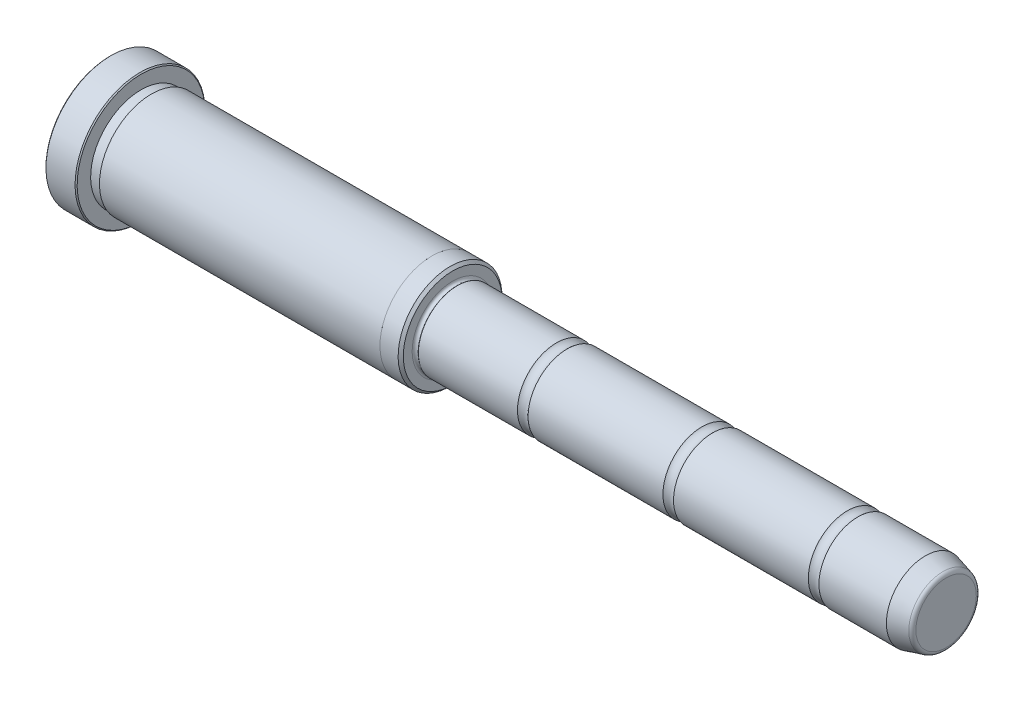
ISO-10303-21;
HEADER;
FILE_DESCRIPTION(('STEP AP214'),'2;1');
FILE_NAME('part.step','',(''),(''),'','','');
FILE_SCHEMA(('AUTOMOTIVE_DESIGN { 1 0 10303 214 1 1 1 1 }'));
ENDSEC;
DATA;
#1=APPLICATION_CONTEXT('core data for automotive mechanical design processes');
#2=APPLICATION_PROTOCOL_DEFINITION('international standard','automotive_design',2000,#1);
#3=PRODUCT_CONTEXT('',#1,'mechanical');
#4=PRODUCT('Part','Part','',(#3));
#5=PRODUCT_RELATED_PRODUCT_CATEGORY('part','',(#4));
#6=PRODUCT_DEFINITION_FORMATION('','',#4);
#7=PRODUCT_DEFINITION_CONTEXT('part definition',#1,'design');
#8=PRODUCT_DEFINITION('design','',#6,#7);
#9=PRODUCT_DEFINITION_SHAPE('','',#8);
#10=(LENGTH_UNIT() NAMED_UNIT(*) SI_UNIT(.MILLI.,.METRE.));
#11=(NAMED_UNIT(*) PLANE_ANGLE_UNIT() SI_UNIT($,.RADIAN.));
#12=(NAMED_UNIT(*) SI_UNIT($,.STERADIAN.) SOLID_ANGLE_UNIT());
#13=UNCERTAINTY_MEASURE_WITH_UNIT(LENGTH_MEASURE(1.E-05),#10,'distance_accuracy_value','');
#14=(GEOMETRIC_REPRESENTATION_CONTEXT(3) GLOBAL_UNCERTAINTY_ASSIGNED_CONTEXT((#13)) GLOBAL_UNIT_ASSIGNED_CONTEXT((#10,
#11,#12)) REPRESENTATION_CONTEXT('',''));
#15=CARTESIAN_POINT('',(0.,0.,0.));
#16=DIRECTION('',(0.,0.,1.));
#17=DIRECTION('',(1.,0.,0.));
#18=AXIS2_PLACEMENT_3D('',#15,#16,#17);
#19=CARTESIAN_POINT('',(95.,0.,0.));
#20=DIRECTION('',(1.,0.,0.));
#21=DIRECTION('',(0.,1.,0.));
#22=AXIS2_PLACEMENT_3D('',#19,#20,#21);
#23=CYLINDRICAL_SURFACE('',#22,7.49999999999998);
#24=CARTESIAN_POINT('',(0.899999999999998,0.,0.));
#25=DIRECTION('',(1.,0.,0.));
#26=DIRECTION('',(0.,1.,0.));
#27=AXIS2_PLACEMENT_3D('',#24,#25,#26);
#28=CIRCLE('',#27,7.49999999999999);
#29=CARTESIAN_POINT('',(0.899999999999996,7.5,0.));
#30=VERTEX_POINT('',#29);
#31=EDGE_CURVE('E63',#30,#30,#28,.T.);
#32=ORIENTED_EDGE('',*,*,#31,.T.);
#33=EDGE_LOOP('',(#32));
#34=FACE_BOUND('',#33,.T.);
#35=CARTESIAN_POINT('',(19.9801960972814,0.,0.));
#36=DIRECTION('',(-1.,0.,0.));
#37=DIRECTION('',(0.,-1.,0.));
#38=AXIS2_PLACEMENT_3D('',#35,#36,#37);
#39=CIRCLE('',#38,7.49999999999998);
#40=CARTESIAN_POINT('',(19.9801960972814,-7.49999999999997,0.));
#41=VERTEX_POINT('',#40);
#42=EDGE_CURVE('E99',#41,#41,#39,.T.);
#43=ORIENTED_EDGE('',*,*,#42,.T.);
#44=EDGE_LOOP('',(#43));
#45=FACE_BOUND('',#44,.T.);
#46=ADVANCED_FACE('F28',(#34,#45),#23,.T.);
#47=CARTESIAN_POINT('',(0.5,0.,0.));
#48=DIRECTION('',(1.,0.,0.));
#49=DIRECTION('',(0.,1.,0.));
#50=AXIS2_PLACEMENT_3D('',#47,#48,#49);
#51=TOROIDAL_SURFACE('',#50,7.79999999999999,0.5);
#52=CARTESIAN_POINT('',(0.,0.,0.));
#53=DIRECTION('',(1.,0.,0.));
#54=DIRECTION('',(0.,1.,0.));
#55=AXIS2_PLACEMENT_3D('',#52,#53,#54);
#56=CIRCLE('',#55,7.79999999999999);
#57=CARTESIAN_POINT('',(0.,7.8,0.));
#58=VERTEX_POINT('',#57);
#59=EDGE_CURVE('E66',#58,#58,#56,.T.);
#60=ORIENTED_EDGE('',*,*,#59,.T.);
#61=EDGE_LOOP('',(#60));
#62=FACE_BOUND('',#61,.T.);
#63=ORIENTED_EDGE('',*,*,#31,.F.);
#64=EDGE_LOOP('',(#63));
#65=FACE_BOUND('',#64,.T.);
#66=ADVANCED_FACE('F122',(#62,#65),#51,.F.);
#67=CARTESIAN_POINT('',(0.,7.8,0.));
#68=DIRECTION('',(1.,0.,0.));
#69=DIRECTION('',(0.,1.,0.));
#70=AXIS2_PLACEMENT_3D('',#67,#68,#69);
#71=PLANE('',#70);
#72=CARTESIAN_POINT('',(0.,0.,0.));
#73=DIRECTION('',(1.,0.,0.));
#74=DIRECTION('',(0.,1.,0.));
#75=AXIS2_PLACEMENT_3D('',#72,#73,#74);
#76=CIRCLE('',#75,9.49999999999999);
#77=CARTESIAN_POINT('',(0.,9.5,0.));
#78=VERTEX_POINT('',#77);
#79=EDGE_CURVE('E35',#78,#78,#76,.T.);
#80=ORIENTED_EDGE('',*,*,#79,.T.);
#81=EDGE_LOOP('',(#80));
#82=FACE_BOUND('',#81,.T.);
#83=ORIENTED_EDGE('',*,*,#59,.F.);
#84=EDGE_LOOP('',(#83));
#85=FACE_BOUND('',#84,.T.);
#86=ADVANCED_FACE('F130',(#82,#85),#71,.T.);
#87=CARTESIAN_POINT('',(95.,0.,0.));
#88=DIRECTION('',(1.,0.,0.));
#89=DIRECTION('',(0.,1.,0.));
#90=AXIS2_PLACEMENT_3D('',#87,#88,#89);
#91=CYLINDRICAL_SURFACE('',#90,9.99999999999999);
#92=CARTESIAN_POINT('',(-0.499999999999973,0.,0.));
#93=DIRECTION('',(1.,0.,0.));
#94=DIRECTION('',(0.,1.,0.));
#95=AXIS2_PLACEMENT_3D('',#92,#93,#94);
#96=CIRCLE('',#95,9.99999999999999);
#97=CARTESIAN_POINT('',(-0.499999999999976,10.,0.));
#98=VERTEX_POINT('',#97);
#99=EDGE_CURVE('E10',#98,#98,#96,.F.);
#100=ORIENTED_EDGE('',*,*,#99,.T.);
#101=EDGE_LOOP('',(#100));
#102=FACE_BOUND('',#101,.T.);
#103=CARTESIAN_POINT('',(-4.,0.,0.));
#104=DIRECTION('',(1.,0.,0.));
#105=DIRECTION('',(0.,1.,0.));
#106=AXIS2_PLACEMENT_3D('',#103,#104,#105);
#107=CIRCLE('',#106,9.99999999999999);
#108=CARTESIAN_POINT('',(-4.00000000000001,10.,0.));
#109=VERTEX_POINT('',#108);
#110=EDGE_CURVE('E69',#109,#109,#107,.T.);
#111=ORIENTED_EDGE('',*,*,#110,.T.);
#112=EDGE_LOOP('',(#111));
#113=FACE_BOUND('',#112,.T.);
#114=ADVANCED_FACE('F190',(#102,#113),#91,.T.);
#115=CARTESIAN_POINT('',(-4.,10.001,0.));
#116=DIRECTION('',(1.,0.,0.));
#117=DIRECTION('',(0.,1.,0.));
#118=AXIS2_PLACEMENT_3D('',#115,#116,#117);
#119=PLANE('',#118);
#120=CARTESIAN_POINT('',(-4.,0.,0.));
#121=DIRECTION('',(1.,0.,0.));
#122=DIRECTION('',(0.,1.,0.));
#123=AXIS2_PLACEMENT_3D('',#120,#121,#122);
#124=CIRCLE('',#123,10.001);
#125=CARTESIAN_POINT('',(-4.00000000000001,10.001,0.));
#126=VERTEX_POINT('',#125);
#127=EDGE_CURVE('E72',#126,#126,#124,.T.);
#128=ORIENTED_EDGE('',*,*,#127,.T.);
#129=EDGE_LOOP('',(#128));
#130=FACE_BOUND('',#129,.T.);
#131=ORIENTED_EDGE('',*,*,#110,.F.);
#132=EDGE_LOOP('',(#131));
#133=FACE_BOUND('',#132,.T.);
#134=ADVANCED_FACE('F186',(#130,#133),#119,.T.);
#135=CARTESIAN_POINT('',(95.,0.,0.));
#136=DIRECTION('',(1.,0.,0.));
#137=DIRECTION('',(0.,1.,0.));
#138=AXIS2_PLACEMENT_3D('',#135,#136,#137);
#139=CYLINDRICAL_SURFACE('',#138,10.001);
#140=CARTESIAN_POINT('',(-58.,0.,0.));
#141=DIRECTION('',(1.,0.,0.));
#142=DIRECTION('',(0.,1.,0.));
#143=AXIS2_PLACEMENT_3D('',#140,#141,#142);
#144=CIRCLE('',#143,10.001);
#145=CARTESIAN_POINT('',(-58.,10.001,0.));
#146=VERTEX_POINT('',#145);
#147=EDGE_CURVE('E75',#146,#146,#144,.T.);
#148=ORIENTED_EDGE('',*,*,#147,.T.);
#149=EDGE_LOOP('',(#148));
#150=FACE_BOUND('',#149,.T.);
#151=ORIENTED_EDGE('',*,*,#127,.F.);
#152=EDGE_LOOP('',(#151));
#153=FACE_BOUND('',#152,.T.);
#154=ADVANCED_FACE('F182',(#150,#153),#139,.T.);
#155=CARTESIAN_POINT('',(-58.,10.001,0.));
#156=DIRECTION('',(-1.,0.,0.));
#157=DIRECTION('',(0.,-1.,0.));
#158=AXIS2_PLACEMENT_3D('',#155,#156,#157);
#159=PLANE('',#158);
#160=CARTESIAN_POINT('',(-58.,0.,0.));
#161=DIRECTION('',(1.,0.,0.));
#162=DIRECTION('',(0.,1.,0.));
#163=AXIS2_PLACEMENT_3D('',#160,#161,#162);
#164=CIRCLE('',#163,9.69999999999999);
#165=CARTESIAN_POINT('',(-58.,9.69999999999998,0.));
#166=VERTEX_POINT('',#165);
#167=EDGE_CURVE('E78',#166,#166,#164,.T.);
#168=ORIENTED_EDGE('',*,*,#167,.T.);
#169=EDGE_LOOP('',(#168));
#170=FACE_BOUND('',#169,.T.);
#171=ORIENTED_EDGE('',*,*,#147,.F.);
#172=EDGE_LOOP('',(#171));
#173=FACE_BOUND('',#172,.T.);
#174=ADVANCED_FACE('F178',(#170,#173),#159,.T.);
#175=CARTESIAN_POINT('',(95.,0.,0.));
#176=DIRECTION('',(1.,0.,0.));
#177=DIRECTION('',(0.,1.,0.));
#178=AXIS2_PLACEMENT_3D('',#175,#176,#177);
#179=CYLINDRICAL_SURFACE('',#178,9.69999999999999);
#180=CARTESIAN_POINT('',(-60.,0.,0.));
#181=DIRECTION('',(1.,0.,0.));
#182=DIRECTION('',(0.,1.,0.));
#183=AXIS2_PLACEMENT_3D('',#180,#181,#182);
#184=CIRCLE('',#183,9.69999999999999);
#185=CARTESIAN_POINT('',(-60.,9.69999999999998,0.));
#186=VERTEX_POINT('',#185);
#187=EDGE_CURVE('E81',#186,#186,#184,.T.);
#188=ORIENTED_EDGE('',*,*,#187,.T.);
#189=EDGE_LOOP('',(#188));
#190=FACE_BOUND('',#189,.T.);
#191=ORIENTED_EDGE('',*,*,#167,.F.);
#192=EDGE_LOOP('',(#191));
#193=FACE_BOUND('',#192,.T.);
#194=ADVANCED_FACE('F174',(#190,#193),#179,.T.);
#195=CARTESIAN_POINT('',(-60.,9.69999999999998,0.));
#196=DIRECTION('',(1.,0.,0.));
#197=DIRECTION('',(0.,1.,0.));
#198=AXIS2_PLACEMENT_3D('',#195,#196,#197);
#199=PLANE('',#198);
#200=CARTESIAN_POINT('',(-60.,0.,0.));
#201=DIRECTION('',(1.,0.,0.));
#202=DIRECTION('',(0.,1.,0.));
#203=AXIS2_PLACEMENT_3D('',#200,#201,#202);
#204=CIRCLE('',#203,12.3);
#205=CARTESIAN_POINT('',(-60.,12.3,0.));
#206=VERTEX_POINT('',#205);
#207=EDGE_CURVE('E39',#206,#206,#204,.T.);
#208=ORIENTED_EDGE('',*,*,#207,.T.);
#209=EDGE_LOOP('',(#208));
#210=FACE_BOUND('',#209,.T.);
#211=ORIENTED_EDGE('',*,*,#187,.F.);
#212=EDGE_LOOP('',(#211));
#213=FACE_BOUND('',#212,.T.);
#214=ADVANCED_FACE('F170',(#210,#213),#199,.T.);
#215=CARTESIAN_POINT('',(95.,0.,0.));
#216=DIRECTION('',(1.,0.,0.));
#217=DIRECTION('',(0.,1.,0.));
#218=AXIS2_PLACEMENT_3D('',#215,#216,#217);
#219=CYLINDRICAL_SURFACE('',#218,12.5);
#220=CARTESIAN_POINT('',(-65.8000000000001,0.,0.));
#221=DIRECTION('',(-1.,0.,0.));
#222=DIRECTION('',(0.,-1.,0.));
#223=AXIS2_PLACEMENT_3D('',#220,#221,#222);
#224=CIRCLE('',#223,12.5);
#225=CARTESIAN_POINT('',(-65.8000000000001,12.5,0.));
#226=VERTEX_POINT('',#225);
#227=EDGE_CURVE('E48',#226,#226,#224,.F.);
#228=ORIENTED_EDGE('',*,*,#227,.T.);
#229=EDGE_LOOP('',(#228));
#230=FACE_BOUND('',#229,.T.);
#231=CARTESIAN_POINT('',(-60.2000000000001,0.,0.));
#232=DIRECTION('',(1.,0.,0.));
#233=DIRECTION('',(0.,1.,0.));
#234=AXIS2_PLACEMENT_3D('',#231,#232,#233);
#235=CIRCLE('',#234,12.5);
#236=CARTESIAN_POINT('',(-60.2000000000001,12.5,0.));
#237=VERTEX_POINT('',#236);
#238=EDGE_CURVE('E51',#237,#237,#235,.F.);
#239=ORIENTED_EDGE('',*,*,#238,.T.);
#240=EDGE_LOOP('',(#239));
#241=FACE_BOUND('',#240,.T.);
#242=ADVANCED_FACE('F117',(#230,#241),#219,.T.);
#243=CARTESIAN_POINT('',(-66.,12.5,0.));
#244=DIRECTION('',(-1.,0.,0.));
#245=DIRECTION('',(0.,-1.,0.));
#246=AXIS2_PLACEMENT_3D('',#243,#244,#245);
#247=PLANE('',#246);
#248=CARTESIAN_POINT('',(-66.,0.,0.));
#249=DIRECTION('',(-1.,0.,0.));
#250=DIRECTION('',(0.,-1.,0.));
#251=AXIS2_PLACEMENT_3D('',#248,#249,#250);
#252=CIRCLE('',#251,12.3000000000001);
#253=CARTESIAN_POINT('',(-66.,12.3,0.));
#254=VERTEX_POINT('',#253);
#255=EDGE_CURVE('E43',#254,#254,#252,.T.);
#256=ORIENTED_EDGE('',*,*,#255,.T.);
#257=EDGE_LOOP('',(#256));
#258=FACE_BOUND('',#257,.T.);
#259=ADVANCED_FACE('F107',(#258),#247,.T.);
#260=CARTESIAN_POINT('',(21.,0.,0.));
#261=DIRECTION('',(-1.,0.,0.));
#262=DIRECTION('',(0.,-1.,0.));
#263=AXIS2_PLACEMENT_3D('',#260,#261,#262);
#264=TOROIDAL_SURFACE('',#263,8.59999999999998,1.5);
#265=CARTESIAN_POINT('',(22.0198039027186,0.,0.));
#266=DIRECTION('',(-1.,0.,0.));
#267=DIRECTION('',(0.,-1.,0.));
#268=AXIS2_PLACEMENT_3D('',#265,#266,#267);
#269=CIRCLE('',#268,7.49999999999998);
#270=CARTESIAN_POINT('',(22.0198039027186,-7.49999999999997,0.));
#271=VERTEX_POINT('',#270);
#272=EDGE_CURVE('E96',#271,#271,#269,.T.);
#273=ORIENTED_EDGE('',*,*,#272,.T.);
#274=EDGE_LOOP('',(#273));
#275=FACE_BOUND('',#274,.T.);
#276=ORIENTED_EDGE('',*,*,#42,.F.);
#277=EDGE_LOOP('',(#276));
#278=FACE_BOUND('',#277,.T.);
#279=ADVANCED_FACE('F104',(#275,#278),#264,.F.);
#280=CARTESIAN_POINT('',(95.,6.42820323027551,0.));
#281=DIRECTION('',(1.,0.,0.));
#282=DIRECTION('',(0.,1.,0.));
#283=AXIS2_PLACEMENT_3D('',#280,#281,#282);
#284=PLANE('',#283);
#285=CARTESIAN_POINT('',(95.,0.,0.));
#286=DIRECTION('',(1.,0.,0.));
#287=DIRECTION('',(0.,1.,0.));
#288=AXIS2_PLACEMENT_3D('',#285,#286,#287);
#289=CIRCLE('',#288,5.8143416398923);
#290=CARTESIAN_POINT('',(95.,5.81434163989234,0.));
#291=VERTEX_POINT('',#290);
#292=EDGE_CURVE('E57',#291,#291,#289,.T.);
#293=ORIENTED_EDGE('',*,*,#292,.T.);
#294=EDGE_LOOP('',(#293));
#295=FACE_BOUND('',#294,.T.);
#296=ADVANCED_FACE('F106',(#295),#284,.T.);
#297=CARTESIAN_POINT('',(95.,0.,0.));
#298=DIRECTION('',(-1.,0.,0.));
#299=DIRECTION('',(0.,-1.,0.));
#300=AXIS2_PLACEMENT_3D('',#297,#298,#299);
#301=CONICAL_SURFACE('',#300,6.42820323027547,0.26179938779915);
#302=CARTESIAN_POINT('',(94.407055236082,0.,0.));
#303=DIRECTION('',(1.,0.,0.));
#304=DIRECTION('',(0.,1.,0.));
#305=AXIS2_PLACEMENT_3D('',#302,#303,#304);
#306=CIRCLE('',#305,6.58708230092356);
#307=CARTESIAN_POINT('',(94.407055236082,6.5870823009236,0.));
#308=VERTEX_POINT('',#307);
#309=EDGE_CURVE('E54',#308,#308,#306,.F.);
#310=ORIENTED_EDGE('',*,*,#309,.T.);
#311=EDGE_LOOP('',(#310));
#312=FACE_BOUND('',#311,.T.);
#313=CARTESIAN_POINT('',(91.,0.,0.));
#314=DIRECTION('',(1.,0.,0.));
#315=DIRECTION('',(0.,1.,0.));
#316=AXIS2_PLACEMENT_3D('',#313,#314,#315);
#317=CIRCLE('',#316,7.49999999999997);
#318=CARTESIAN_POINT('',(91.,7.5,0.));
#319=VERTEX_POINT('',#318);
#320=EDGE_CURVE('E60',#319,#319,#317,.T.);
#321=ORIENTED_EDGE('',*,*,#320,.T.);
#322=EDGE_LOOP('',(#321));
#323=FACE_BOUND('',#322,.T.);
#324=ADVANCED_FACE('F114',(#312,#323),#301,.T.);
#325=ORIENTED_EDGE('',*,*,#320,.F.);
#326=EDGE_LOOP('',(#325));
#327=FACE_BOUND('',#326,.T.);
#328=CARTESIAN_POINT('',(78.0198039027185,0.,0.));
#329=DIRECTION('',(-1.,0.,0.));
#330=DIRECTION('',(0.,-1.,0.));
#331=AXIS2_PLACEMENT_3D('',#328,#329,#330);
#332=CIRCLE('',#331,7.49999999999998);
#333=CARTESIAN_POINT('',(78.0198039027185,-7.49999999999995,0.));
#334=VERTEX_POINT('',#333);
#335=EDGE_CURVE('E84',#334,#334,#332,.T.);
#336=ORIENTED_EDGE('',*,*,#335,.F.);
#337=EDGE_LOOP('',(#336));
#338=FACE_BOUND('',#337,.T.);
#339=ADVANCED_FACE('F126',(#327,#338),#23,.T.);
#340=CARTESIAN_POINT('',(77.,0.,0.));
#341=DIRECTION('',(-1.,0.,0.));
#342=DIRECTION('',(0.,-1.,0.));
#343=AXIS2_PLACEMENT_3D('',#340,#341,#342);
#344=TOROIDAL_SURFACE('',#343,8.59999999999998,1.49999999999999);
#345=ORIENTED_EDGE('',*,*,#335,.T.);
#346=EDGE_LOOP('',(#345));
#347=FACE_BOUND('',#346,.T.);
#348=CARTESIAN_POINT('',(75.9801960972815,0.,0.));
#349=DIRECTION('',(-1.,0.,0.));
#350=DIRECTION('',(0.,-1.,0.));
#351=AXIS2_PLACEMENT_3D('',#348,#349,#350);
#352=CIRCLE('',#351,7.49999999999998);
#353=CARTESIAN_POINT('',(75.9801960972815,-7.49999999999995,0.));
#354=VERTEX_POINT('',#353);
#355=EDGE_CURVE('E87',#354,#354,#352,.T.);
#356=ORIENTED_EDGE('',*,*,#355,.F.);
#357=EDGE_LOOP('',(#356));
#358=FACE_BOUND('',#357,.T.);
#359=ADVANCED_FACE('F140',(#347,#358),#344,.F.);
#360=ORIENTED_EDGE('',*,*,#355,.T.);
#361=EDGE_LOOP('',(#360));
#362=FACE_BOUND('',#361,.T.);
#363=CARTESIAN_POINT('',(50.0198039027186,0.,0.));
#364=DIRECTION('',(-1.,0.,0.));
#365=DIRECTION('',(0.,-1.,0.));
#366=AXIS2_PLACEMENT_3D('',#363,#364,#365);
#367=CIRCLE('',#366,7.49999999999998);
#368=CARTESIAN_POINT('',(50.0198039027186,-7.49999999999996,0.));
#369=VERTEX_POINT('',#368);
#370=EDGE_CURVE('E90',#369,#369,#367,.T.);
#371=ORIENTED_EDGE('',*,*,#370,.F.);
#372=EDGE_LOOP('',(#371));
#373=FACE_BOUND('',#372,.T.);
#374=ADVANCED_FACE('F138',(#362,#373),#23,.T.);
#375=CARTESIAN_POINT('',(49.,0.,0.));
#376=DIRECTION('',(-1.,0.,0.));
#377=DIRECTION('',(0.,-1.,0.));
#378=AXIS2_PLACEMENT_3D('',#375,#376,#377);
#379=TOROIDAL_SURFACE('',#378,8.59999999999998,1.5);
#380=ORIENTED_EDGE('',*,*,#370,.T.);
#381=EDGE_LOOP('',(#380));
#382=FACE_BOUND('',#381,.T.);
#383=CARTESIAN_POINT('',(47.9801960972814,0.,0.));
#384=DIRECTION('',(-1.,0.,0.));
#385=DIRECTION('',(0.,-1.,0.));
#386=AXIS2_PLACEMENT_3D('',#383,#384,#385);
#387=CIRCLE('',#386,7.49999999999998);
#388=CARTESIAN_POINT('',(47.9801960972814,-7.49999999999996,0.));
#389=VERTEX_POINT('',#388);
#390=EDGE_CURVE('E93',#389,#389,#387,.T.);
#391=ORIENTED_EDGE('',*,*,#390,.F.);
#392=EDGE_LOOP('',(#391));
#393=FACE_BOUND('',#392,.T.);
#394=ADVANCED_FACE('F136',(#382,#393),#379,.F.);
#395=ORIENTED_EDGE('',*,*,#390,.T.);
#396=EDGE_LOOP('',(#395));
#397=FACE_BOUND('',#396,.T.);
#398=ORIENTED_EDGE('',*,*,#272,.F.);
#399=EDGE_LOOP('',(#398));
#400=FACE_BOUND('',#399,.T.);
#401=ADVANCED_FACE('F125',(#397,#400),#23,.T.);
#402=CARTESIAN_POINT('',(94.2,0.,0.));
#403=DIRECTION('',(1.,0.,0.));
#404=DIRECTION('',(0.,1.,0.));
#405=AXIS2_PLACEMENT_3D('',#402,#403,#404);
#406=TOROIDAL_SURFACE('',#405,5.8143416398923,0.8);
#407=ORIENTED_EDGE('',*,*,#309,.F.);
#408=EDGE_LOOP('',(#407));
#409=FACE_BOUND('',#408,.T.);
#410=ORIENTED_EDGE('',*,*,#292,.F.);
#411=EDGE_LOOP('',(#410));
#412=FACE_BOUND('',#411,.T.);
#413=ADVANCED_FACE('F135',(#409,#412),#406,.T.);
#414=CARTESIAN_POINT('',(-65.8000000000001,0.,0.));
#415=DIRECTION('',(1.,0.,0.));
#416=DIRECTION('',(0.,1.,0.));
#417=AXIS2_PLACEMENT_3D('',#414,#415,#416);
#418=CONICAL_SURFACE('',#417,12.5,0.785398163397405);
#419=CARTESIAN_POINT('',(-66.,12.3,0.));
#420=CARTESIAN_POINT('',(-65.9979166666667,12.3020833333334,0.));
#421=CARTESIAN_POINT('',(-65.9958333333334,12.3041666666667,0.));
#422=CARTESIAN_POINT('',(-65.9916666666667,12.3083333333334,0.));
#423=CARTESIAN_POINT('',(-65.9895833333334,12.3104166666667,0.));
#424=CARTESIAN_POINT('',(-65.9854166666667,12.3145833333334,0.));
#425=CARTESIAN_POINT('',(-65.9833333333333,12.3166666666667,0.));
#426=CARTESIAN_POINT('',(-65.9791666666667,12.3208333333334,0.));
#427=CARTESIAN_POINT('',(-65.9770833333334,12.3229166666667,0.));
#428=CARTESIAN_POINT('',(-65.9729166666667,12.3270833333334,0.));
#429=CARTESIAN_POINT('',(-65.9708333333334,12.3291666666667,0.));
#430=CARTESIAN_POINT('',(-65.9666666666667,12.3333333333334,0.));
#431=CARTESIAN_POINT('',(-65.9645833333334,12.3354166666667,0.));
#432=CARTESIAN_POINT('',(-65.9604166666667,12.3395833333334,0.));
#433=CARTESIAN_POINT('',(-65.9583333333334,12.3416666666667,0.));
#434=CARTESIAN_POINT('',(-65.9541666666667,12.3458333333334,0.));
#435=CARTESIAN_POINT('',(-65.9520833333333,12.3479166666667,0.));
#436=CARTESIAN_POINT('',(-65.9479166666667,12.3520833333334,0.));
#437=CARTESIAN_POINT('',(-65.9458333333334,12.3541666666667,0.));
#438=CARTESIAN_POINT('',(-65.9416666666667,12.3583333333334,0.));
#439=CARTESIAN_POINT('',(-65.9395833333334,12.3604166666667,0.));
#440=CARTESIAN_POINT('',(-65.9354166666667,12.3645833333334,0.));
#441=CARTESIAN_POINT('',(-65.9333333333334,12.3666666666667,0.));
#442=CARTESIAN_POINT('',(-65.9291666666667,12.3708333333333,0.));
#443=CARTESIAN_POINT('',(-65.9270833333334,12.3729166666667,0.));
#444=CARTESIAN_POINT('',(-65.9229166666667,12.3770833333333,0.));
#445=CARTESIAN_POINT('',(-65.9208333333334,12.3791666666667,0.));
#446=CARTESIAN_POINT('',(-65.9166666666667,12.3833333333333,0.));
#447=CARTESIAN_POINT('',(-65.9145833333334,12.3854166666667,0.));
#448=CARTESIAN_POINT('',(-65.9104166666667,12.3895833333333,0.));
#449=CARTESIAN_POINT('',(-65.9083333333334,12.3916666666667,0.));
#450=CARTESIAN_POINT('',(-65.9041666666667,12.3958333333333,0.));
#451=CARTESIAN_POINT('',(-65.9020833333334,12.3979166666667,0.));
#452=CARTESIAN_POINT('',(-65.8979166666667,12.4020833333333,0.));
#453=CARTESIAN_POINT('',(-65.8958333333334,12.4041666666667,0.));
#454=CARTESIAN_POINT('',(-65.8916666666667,12.4083333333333,0.));
#455=CARTESIAN_POINT('',(-65.8895833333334,12.4104166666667,0.));
#456=CARTESIAN_POINT('',(-65.8854166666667,12.4145833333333,0.));
#457=CARTESIAN_POINT('',(-65.8833333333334,12.4166666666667,0.));
#458=CARTESIAN_POINT('',(-65.8791666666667,12.4208333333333,0.));
#459=CARTESIAN_POINT('',(-65.8770833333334,12.4229166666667,0.));
#460=CARTESIAN_POINT('',(-65.8729166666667,12.4270833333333,0.));
#461=CARTESIAN_POINT('',(-65.8708333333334,12.4291666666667,0.));
#462=CARTESIAN_POINT('',(-65.8666666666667,12.4333333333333,0.));
#463=CARTESIAN_POINT('',(-65.8645833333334,12.4354166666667,0.));
#464=CARTESIAN_POINT('',(-65.8604166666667,12.4395833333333,0.));
#465=CARTESIAN_POINT('',(-65.8583333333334,12.4416666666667,0.));
#466=CARTESIAN_POINT('',(-65.8541666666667,12.4458333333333,0.));
#467=CARTESIAN_POINT('',(-65.8520833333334,12.4479166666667,0.));
#468=CARTESIAN_POINT('',(-65.8479166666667,12.4520833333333,0.));
#469=CARTESIAN_POINT('',(-65.8458333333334,12.4541666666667,0.));
#470=CARTESIAN_POINT('',(-65.8416666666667,12.4583333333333,0.));
#471=CARTESIAN_POINT('',(-65.8395833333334,12.4604166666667,0.));
#472=CARTESIAN_POINT('',(-65.8354166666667,12.4645833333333,0.));
#473=CARTESIAN_POINT('',(-65.8333333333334,12.4666666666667,0.));
#474=CARTESIAN_POINT('',(-65.8291666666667,12.4708333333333,0.));
#475=CARTESIAN_POINT('',(-65.8270833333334,12.4729166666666,0.));
#476=CARTESIAN_POINT('',(-65.8229166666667,12.4770833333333,0.));
#477=CARTESIAN_POINT('',(-65.8208333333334,12.4791666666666,0.));
#478=CARTESIAN_POINT('',(-65.8166666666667,12.4833333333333,0.));
#479=CARTESIAN_POINT('',(-65.8145833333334,12.4854166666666,0.));
#480=CARTESIAN_POINT('',(-65.8104166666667,12.4895833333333,0.));
#481=CARTESIAN_POINT('',(-65.8083333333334,12.4916666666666,0.));
#482=CARTESIAN_POINT('',(-65.8041666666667,12.4958333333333,0.));
#483=CARTESIAN_POINT('',(-65.8020833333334,12.4979166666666,0.));
#484=CARTESIAN_POINT('',(-65.8000000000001,12.5,0.));
#485=B_SPLINE_CURVE_WITH_KNOTS('',3,(#419,#420,#421,#422,#423,#424,#425,#426,#427,#428,#429,
#430,#431,#432,#433,#434,#435,#436,#437,#438,#439,#440,#441,#442,#443,#444,#445,#446,#447,#448,
#449,#450,#451,#452,#453,#454,#455,#456,#457,#458,#459,#460,#461,#462,#463,#464,#465,#466,#467,
#468,#469,#470,#471,#472,#473,#474,#475,#476,#477,#478,#479,#480,#481,#482,#483,#484),
.UNSPECIFIED.,.F.,.F.,(4,2,2,2,2,2,2,2,2,2,2,2,2,2,2,2,2,2,2,2,2,2,2,2,2,2,2,2,2,2,2,2,4),(0.,
0.00883883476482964,0.0176776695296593,0.0265165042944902,0.0353553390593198,0.0441941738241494,
0.0530330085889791,0.0618718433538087,0.0707106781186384,0.0795495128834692,0.0883883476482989,
0.0972271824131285,0.106066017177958,0.114904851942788,0.123743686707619,0.132582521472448,
0.141421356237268,0.150260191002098,0.159099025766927,0.167937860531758,0.176776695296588,
0.185615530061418,0.194454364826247,0.203293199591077,0.212132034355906,0.220970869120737,
0.229809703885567,0.238648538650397,0.247487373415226,0.256326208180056,0.265165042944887,
0.274003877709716,0.282842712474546),.UNSPECIFIED.);
#486=EDGE_CURVE('BSEAM245',#254,#226,#485,.T.);
#487=ORIENTED_EDGE('',*,*,#255,.F.);
#488=ORIENTED_EDGE('',*,*,#227,.F.);
#489=ORIENTED_EDGE('',*,*,#486,.T.);
#490=ORIENTED_EDGE('',*,*,#486,.F.);
#491=EDGE_LOOP('',(#487,#489,#488,#490));
#492=FACE_BOUND('',#491,.T.);
#493=ADVANCED_FACE('F245',(#492),#418,.T.);
#494=CARTESIAN_POINT('',(-60.,0.,0.));
#495=DIRECTION('',(-1.,0.,0.));
#496=DIRECTION('',(0.,-1.,0.));
#497=AXIS2_PLACEMENT_3D('',#494,#495,#496);
#498=CONICAL_SURFACE('',#497,12.3,0.785398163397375);
#499=ORIENTED_EDGE('',*,*,#238,.F.);
#500=EDGE_LOOP('',(#499));
#501=FACE_BOUND('',#500,.T.);
#502=ORIENTED_EDGE('',*,*,#207,.F.);
#503=EDGE_LOOP('',(#502));
#504=FACE_BOUND('',#503,.T.);
#505=ADVANCED_FACE('F249',(#501,#504),#498,.T.);
#506=CARTESIAN_POINT('',(0.,0.,0.));
#507=DIRECTION('',(-1.,0.,0.));
#508=DIRECTION('',(0.,-1.,0.));
#509=AXIS2_PLACEMENT_3D('',#506,#507,#508);
#510=CONICAL_SURFACE('',#509,9.49999999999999,0.785398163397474);
#511=ORIENTED_EDGE('',*,*,#99,.F.);
#512=EDGE_LOOP('',(#511));
#513=FACE_BOUND('',#512,.T.);
#514=ORIENTED_EDGE('',*,*,#79,.F.);
#515=EDGE_LOOP('',(#514));
#516=FACE_BOUND('',#515,.T.);
#517=ADVANCED_FACE('F30',(#513,#516),#510,.T.);
#518=CLOSED_SHELL('',(#46,#66,#86,#114,#134,#154,#174,#194,#214,#242,#259,#279,#296,#324,#339,
#359,#374,#394,#401,#413,#493,#505,#517));
#519=MANIFOLD_SOLID_BREP('B2',#518);
#520=ADVANCED_BREP_SHAPE_REPRESENTATION('',(#18,#519),#14);
#521=SHAPE_DEFINITION_REPRESENTATION(#9,#520);
ENDSEC;
END-ISO-10303-21;
